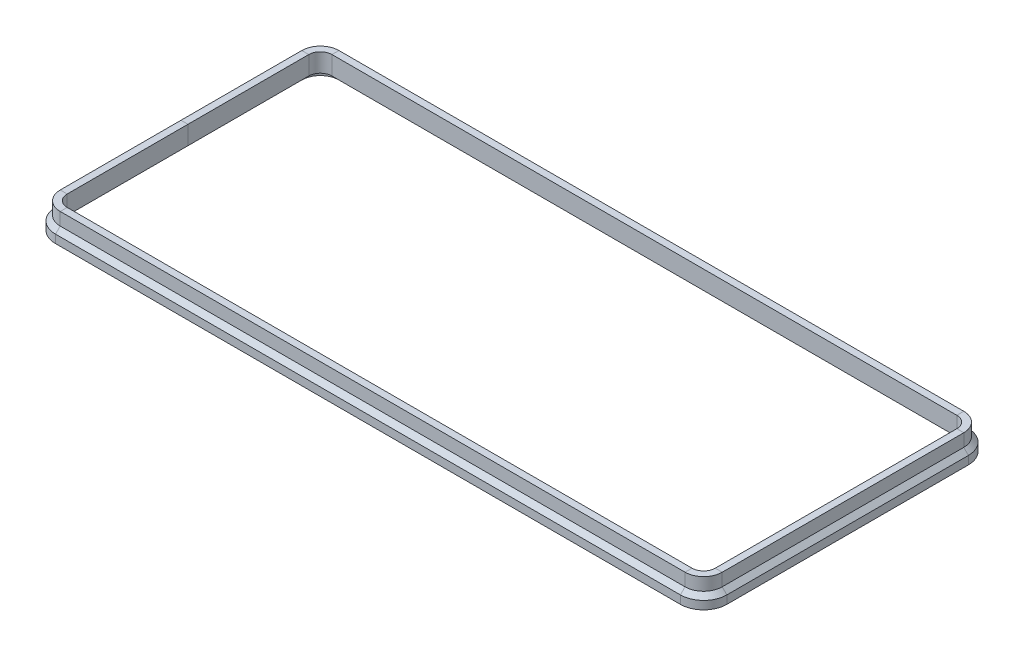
from build123d import *


with BuildPart() as part:
    # Balayage1: sweep along a path in Esquisse1
    with BuildLine(Plane(origin=(0, 0, 0), x_dir=(1, 0, 0), z_dir=(0, 1, 0))) as balayage1_path:
        Line((-134.5, 60), (134.5, 60))
        ThreePointArc((134.5, 60), (140.156854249, 57.656854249), (142.5, 52))
        Line((142.5, 52), (142.5, -52))
        ThreePointArc((142.5, -52), (140.156854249, -57.656854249), (134.5, -60))
        Line((134.5, -60), (-134.5, -60))
        ThreePointArc((-134.5, -60), (-140.156854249, -57.656854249), (-142.5, -52))
        Line((-142.5, -52), (-142.5, 52))
        ThreePointArc((-142.5, 52), (-140.156854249, 57.656854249), (-134.5, 60))
    # Esquisse2 → Balayage1 (sweep)
    with BuildSketch(Plane.XY):
        Polygon((-142.5, 0), (-139.5, 0), (-139.5, 8), (-142.5, 8), (-142.5, 2.538994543), (-144.5, 0.538994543), (-144.5, -3), (-142.5, -3), align=None)
    sweep(path=balayage1_path.line)


solid = part.part
